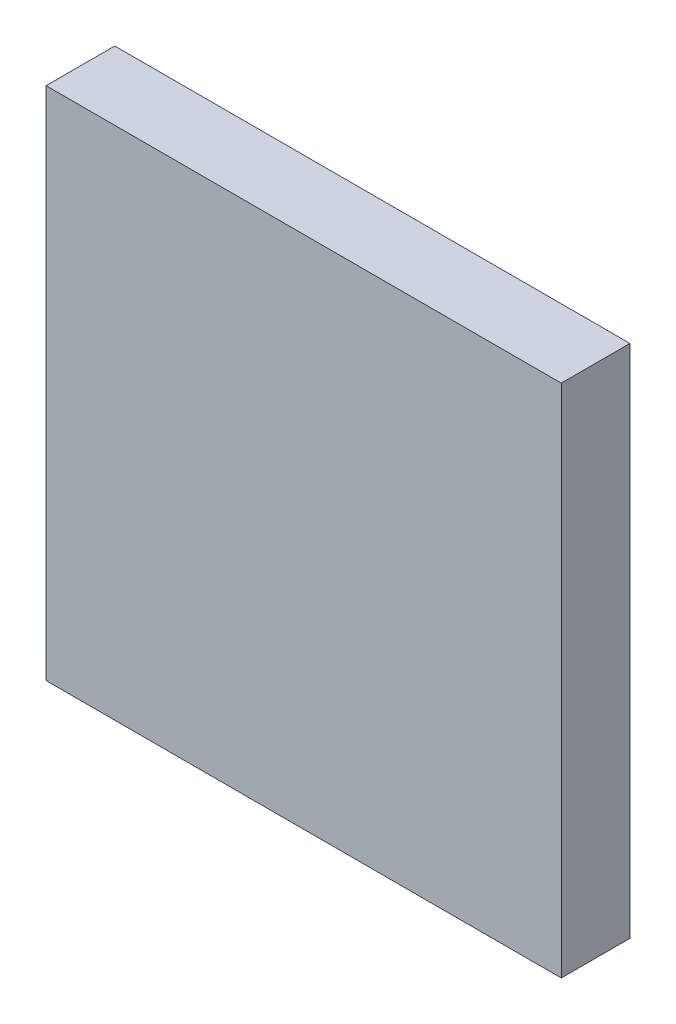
ISO-10303-21;
HEADER;
FILE_DESCRIPTION(('STEP AP214'),'2;1');
FILE_NAME('part.step','',(''),(''),'','','');
FILE_SCHEMA(('AUTOMOTIVE_DESIGN { 1 0 10303 214 1 1 1 1 }'));
ENDSEC;
DATA;
#1=APPLICATION_CONTEXT('core data for automotive mechanical design processes');
#2=APPLICATION_PROTOCOL_DEFINITION('international standard','automotive_design',2000,#1);
#3=PRODUCT_CONTEXT('',#1,'mechanical');
#4=PRODUCT('Part','Part','',(#3));
#5=PRODUCT_RELATED_PRODUCT_CATEGORY('part','',(#4));
#6=PRODUCT_DEFINITION_FORMATION('','',#4);
#7=PRODUCT_DEFINITION_CONTEXT('part definition',#1,'design');
#8=PRODUCT_DEFINITION('design','',#6,#7);
#9=PRODUCT_DEFINITION_SHAPE('','',#8);
#10=(LENGTH_UNIT() NAMED_UNIT(*) SI_UNIT(.MILLI.,.METRE.));
#11=(NAMED_UNIT(*) PLANE_ANGLE_UNIT() SI_UNIT($,.RADIAN.));
#12=(NAMED_UNIT(*) SI_UNIT($,.STERADIAN.) SOLID_ANGLE_UNIT());
#13=UNCERTAINTY_MEASURE_WITH_UNIT(LENGTH_MEASURE(1.E-05),#10,'distance_accuracy_value','');
#14=(GEOMETRIC_REPRESENTATION_CONTEXT(3) GLOBAL_UNCERTAINTY_ASSIGNED_CONTEXT((#13)) GLOBAL_UNIT_ASSIGNED_CONTEXT((#10,
#11,#12)) REPRESENTATION_CONTEXT('',''));
#15=CARTESIAN_POINT('',(0.,0.,0.));
#16=DIRECTION('',(0.,0.,1.));
#17=DIRECTION('',(1.,0.,0.));
#18=AXIS2_PLACEMENT_3D('',#15,#16,#17);
#19=CARTESIAN_POINT('',(0.,0.,0.));
#20=DIRECTION('',(0.,0.,1.));
#21=DIRECTION('',(1.,0.,0.));
#22=AXIS2_PLACEMENT_3D('',#19,#20,#21);
#23=PLANE('',#22);
#24=DIRECTION('',(1.,0.,0.));
#25=VECTOR('',#24,1.);
#26=CARTESIAN_POINT('',(0.,0.,0.));
#27=LINE('',#26,#25);
#28=CARTESIAN_POINT('',(7.5,0.,0.));
#29=VERTEX_POINT('',#28);
#30=CARTESIAN_POINT('',(0.,0.,0.));
#31=VERTEX_POINT('',#30);
#32=EDGE_CURVE('E79',#29,#31,#27,.F.);
#33=ORIENTED_EDGE('',*,*,#32,.F.);
#34=DIRECTION('',(0.,1.,0.));
#35=VECTOR('',#34,1.);
#36=CARTESIAN_POINT('',(7.5,0.,0.));
#37=LINE('',#36,#35);
#38=CARTESIAN_POINT('',(7.5,-7.49999999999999,0.));
#39=VERTEX_POINT('',#38);
#40=EDGE_CURVE('E55',#39,#29,#37,.T.);
#41=ORIENTED_EDGE('',*,*,#40,.F.);
#42=DIRECTION('',(1.,0.,0.));
#43=VECTOR('',#42,1.);
#44=CARTESIAN_POINT('',(0.,-7.49999999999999,0.));
#45=LINE('',#44,#43);
#46=CARTESIAN_POINT('',(0.,-7.49999999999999,0.));
#47=VERTEX_POINT('',#46);
#48=EDGE_CURVE('E67',#39,#47,#45,.F.);
#49=ORIENTED_EDGE('',*,*,#48,.T.);
#50=DIRECTION('',(0.,1.,0.));
#51=VECTOR('',#50,1.);
#52=CARTESIAN_POINT('',(0.,0.,0.));
#53=LINE('',#52,#51);
#54=EDGE_CURVE('E20',#47,#31,#53,.T.);
#55=ORIENTED_EDGE('',*,*,#54,.T.);
#56=EDGE_LOOP('',(#33,#41,#49,#55));
#57=FACE_BOUND('',#56,.T.);
#58=ADVANCED_FACE('F17',(#57),#23,.F.);
#59=CARTESIAN_POINT('',(0.,0.,1.));
#60=DIRECTION('',(1.,0.,0.));
#61=DIRECTION('',(0.,0.,-1.));
#62=AXIS2_PLACEMENT_3D('',#59,#60,#61);
#63=PLANE('',#62);
#64=DIRECTION('',(0.,0.,1.));
#65=VECTOR('',#64,1.);
#66=CARTESIAN_POINT('',(0.,-7.49999999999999,1.));
#67=LINE('',#66,#65);
#68=CARTESIAN_POINT('',(0.,-7.49999999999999,1.));
#69=VERTEX_POINT('',#68);
#70=EDGE_CURVE('E62',#47,#69,#67,.T.);
#71=ORIENTED_EDGE('',*,*,#70,.T.);
#72=DIRECTION('',(0.,1.,0.));
#73=VECTOR('',#72,1.);
#74=CARTESIAN_POINT('',(0.,0.,1.));
#75=LINE('',#74,#73);
#76=CARTESIAN_POINT('',(0.,0.,1.));
#77=VERTEX_POINT('',#76);
#78=EDGE_CURVE('E83',#77,#69,#75,.F.);
#79=ORIENTED_EDGE('',*,*,#78,.F.);
#80=DIRECTION('',(0.,0.,1.));
#81=VECTOR('',#80,1.);
#82=CARTESIAN_POINT('',(0.,0.,1.));
#83=LINE('',#82,#81);
#84=EDGE_CURVE('E65',#31,#77,#83,.T.);
#85=ORIENTED_EDGE('',*,*,#84,.F.);
#86=ORIENTED_EDGE('',*,*,#54,.F.);
#87=EDGE_LOOP('',(#71,#79,#85,#86));
#88=FACE_BOUND('',#87,.T.);
#89=ADVANCED_FACE('F60',(#88),#63,.F.);
#90=CARTESIAN_POINT('',(0.,-7.49999999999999,1.));
#91=DIRECTION('',(0.,1.,0.));
#92=DIRECTION('',(0.,0.,1.));
#93=AXIS2_PLACEMENT_3D('',#90,#91,#92);
#94=PLANE('',#93);
#95=DIRECTION('',(0.,0.,-1.));
#96=VECTOR('',#95,1.);
#97=CARTESIAN_POINT('',(7.5,-7.49999999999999,1.));
#98=LINE('',#97,#96);
#99=CARTESIAN_POINT('',(7.5,-7.49999999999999,1.));
#100=VERTEX_POINT('',#99);
#101=EDGE_CURVE('E77',#100,#39,#98,.T.);
#102=ORIENTED_EDGE('',*,*,#101,.F.);
#103=DIRECTION('',(1.,0.,0.));
#104=VECTOR('',#103,1.);
#105=CARTESIAN_POINT('',(0.,-7.49999999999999,1.));
#106=LINE('',#105,#104);
#107=EDGE_CURVE('E73',#69,#100,#106,.T.);
#108=ORIENTED_EDGE('',*,*,#107,.F.);
#109=ORIENTED_EDGE('',*,*,#70,.F.);
#110=ORIENTED_EDGE('',*,*,#48,.F.);
#111=EDGE_LOOP('',(#102,#108,#109,#110));
#112=FACE_BOUND('',#111,.T.);
#113=ADVANCED_FACE('F71',(#112),#94,.F.);
#114=CARTESIAN_POINT('',(7.5,0.,1.));
#115=DIRECTION('',(1.,0.,0.));
#116=DIRECTION('',(0.,0.,-1.));
#117=AXIS2_PLACEMENT_3D('',#114,#115,#116);
#118=PLANE('',#117);
#119=DIRECTION('',(0.,1.,0.));
#120=VECTOR('',#119,1.);
#121=CARTESIAN_POINT('',(7.5,0.,1.));
#122=LINE('',#121,#120);
#123=CARTESIAN_POINT('',(7.5,0.,1.));
#124=VERTEX_POINT('',#123);
#125=EDGE_CURVE('E26',#100,#124,#122,.T.);
#126=ORIENTED_EDGE('',*,*,#125,.F.);
#127=ORIENTED_EDGE('',*,*,#101,.T.);
#128=ORIENTED_EDGE('',*,*,#40,.T.);
#129=DIRECTION('',(0.,0.,1.));
#130=VECTOR('',#129,1.);
#131=CARTESIAN_POINT('',(7.5,0.,1.));
#132=LINE('',#131,#130);
#133=EDGE_CURVE('E35',#124,#29,#132,.F.);
#134=ORIENTED_EDGE('',*,*,#133,.F.);
#135=EDGE_LOOP('',(#126,#127,#128,#134));
#136=FACE_BOUND('',#135,.T.);
#137=ADVANCED_FACE('F89',(#136),#118,.T.);
#138=CARTESIAN_POINT('',(0.,0.,1.));
#139=DIRECTION('',(0.,1.,0.));
#140=DIRECTION('',(0.,0.,1.));
#141=AXIS2_PLACEMENT_3D('',#138,#139,#140);
#142=PLANE('',#141);
#143=DIRECTION('',(1.,0.,0.));
#144=VECTOR('',#143,1.);
#145=CARTESIAN_POINT('',(0.,0.,1.));
#146=LINE('',#145,#144);
#147=EDGE_CURVE('E11',#124,#77,#146,.F.);
#148=ORIENTED_EDGE('',*,*,#147,.F.);
#149=ORIENTED_EDGE('',*,*,#133,.T.);
#150=ORIENTED_EDGE('',*,*,#32,.T.);
#151=ORIENTED_EDGE('',*,*,#84,.T.);
#152=EDGE_LOOP('',(#148,#149,#150,#151));
#153=FACE_BOUND('',#152,.T.);
#154=ADVANCED_FACE('F91',(#153),#142,.T.);
#155=CARTESIAN_POINT('',(0.,0.,1.));
#156=DIRECTION('',(0.,0.,1.));
#157=DIRECTION('',(1.,0.,0.));
#158=AXIS2_PLACEMENT_3D('',#155,#156,#157);
#159=PLANE('',#158);
#160=ORIENTED_EDGE('',*,*,#125,.T.);
#161=ORIENTED_EDGE('',*,*,#147,.T.);
#162=ORIENTED_EDGE('',*,*,#78,.T.);
#163=ORIENTED_EDGE('',*,*,#107,.T.);
#164=EDGE_LOOP('',(#160,#161,#162,#163));
#165=FACE_BOUND('',#164,.T.);
#166=ADVANCED_FACE('F88',(#165),#159,.T.);
#167=CLOSED_SHELL('',(#58,#89,#113,#137,#154,#166));
#168=MANIFOLD_SOLID_BREP('B1',#167);
#169=ADVANCED_BREP_SHAPE_REPRESENTATION('',(#18,#168),#14);
#170=SHAPE_DEFINITION_REPRESENTATION(#9,#169);
ENDSEC;
END-ISO-10303-21;
